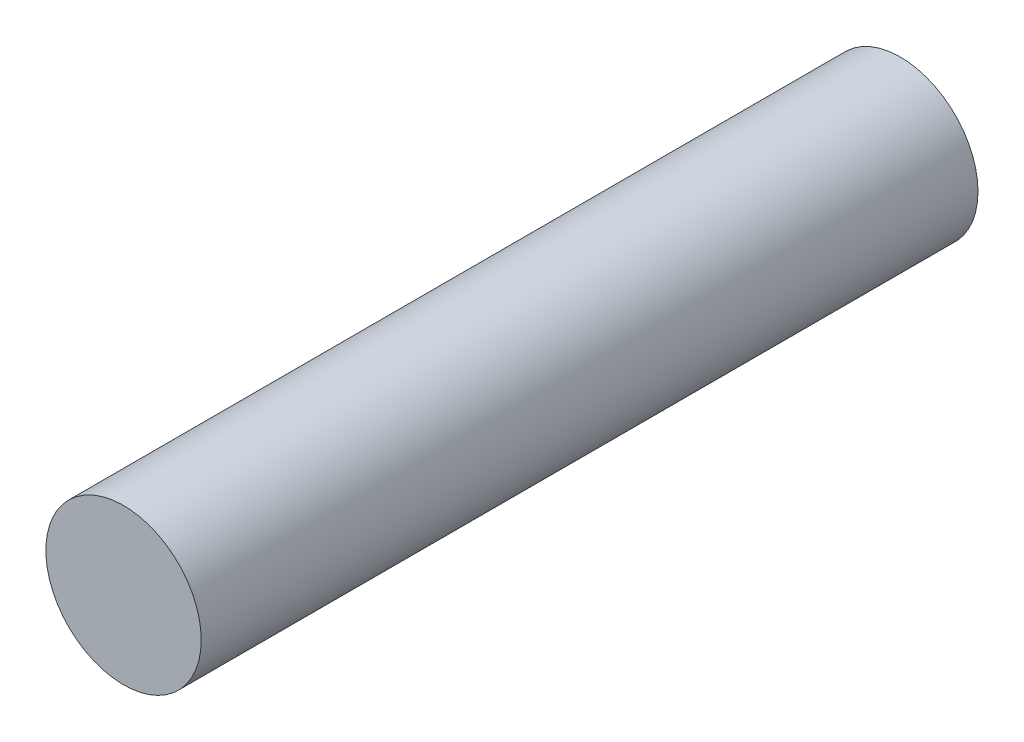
from build123d import *

# Parameters (mm, degrees)
SKIZZE1_R                       = 15
AUFSATZ_LINEAR_AUSTRAGEN1_DEPTH = 150


with BuildPart() as part:
    # Skizze1 → Aufsatz-Linear austragen1 (new body)
    with BuildSketch(Plane.XY):
        Circle(SKIZZE1_R)
    extrude(amount=AUFSATZ_LINEAR_AUSTRAGEN1_DEPTH)


solid = part.part
